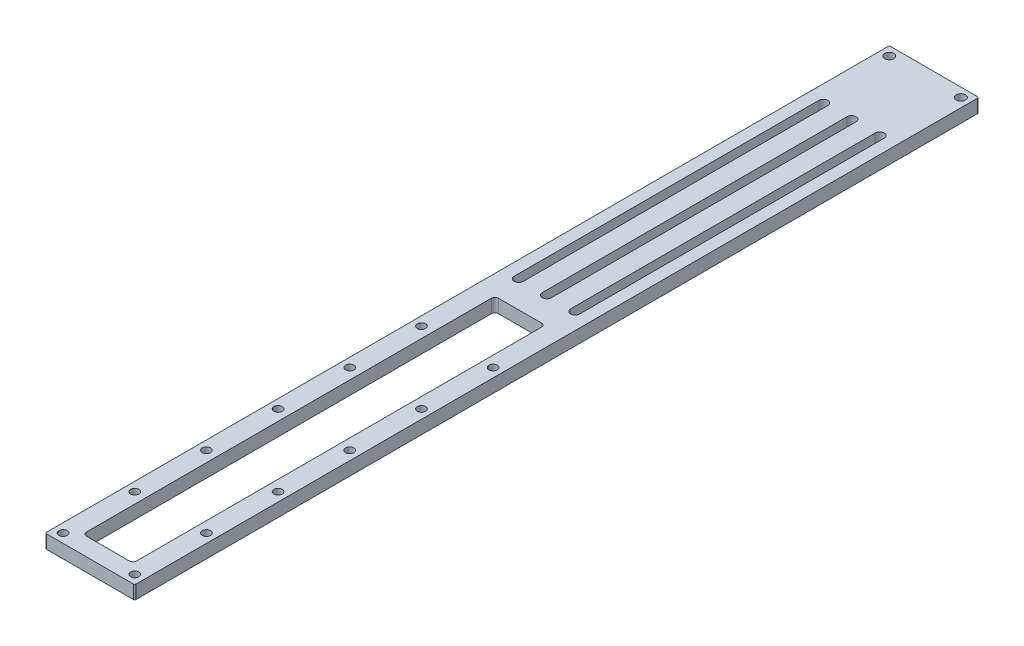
ISO-10303-21;
HEADER;
FILE_DESCRIPTION(('STEP AP214'),'2;1');
FILE_NAME('part.step','',(''),(''),'','','');
FILE_SCHEMA(('AUTOMOTIVE_DESIGN { 1 0 10303 214 1 1 1 1 }'));
ENDSEC;
DATA;
#1=APPLICATION_CONTEXT('core data for automotive mechanical design processes');
#2=APPLICATION_PROTOCOL_DEFINITION('international standard','automotive_design',2000,#1);
#3=PRODUCT_CONTEXT('',#1,'mechanical');
#4=PRODUCT('Part','Part','',(#3));
#5=PRODUCT_RELATED_PRODUCT_CATEGORY('part','',(#4));
#6=PRODUCT_DEFINITION_FORMATION('','',#4);
#7=PRODUCT_DEFINITION_CONTEXT('part definition',#1,'design');
#8=PRODUCT_DEFINITION('design','',#6,#7);
#9=PRODUCT_DEFINITION_SHAPE('','',#8);
#10=(LENGTH_UNIT() NAMED_UNIT(*) SI_UNIT(.MILLI.,.METRE.));
#11=(NAMED_UNIT(*) PLANE_ANGLE_UNIT() SI_UNIT($,.RADIAN.));
#12=(NAMED_UNIT(*) SI_UNIT($,.STERADIAN.) SOLID_ANGLE_UNIT());
#13=UNCERTAINTY_MEASURE_WITH_UNIT(LENGTH_MEASURE(1.E-05),#10,'distance_accuracy_value','');
#14=(GEOMETRIC_REPRESENTATION_CONTEXT(3) GLOBAL_UNCERTAINTY_ASSIGNED_CONTEXT((#13)) GLOBAL_UNIT_ASSIGNED_CONTEXT((#10,
#11,#12)) REPRESENTATION_CONTEXT('',''));
#15=CARTESIAN_POINT('',(0.,0.,0.));
#16=DIRECTION('',(0.,0.,1.));
#17=DIRECTION('',(1.,0.,0.));
#18=AXIS2_PLACEMENT_3D('',#15,#16,#17);
#19=CARTESIAN_POINT('',(-12.7,2.38125,168.9608));
#20=DIRECTION('',(0.,1.,0.));
#21=DIRECTION('',(0.,0.,1.));
#22=AXIS2_PLACEMENT_3D('',#19,#20,#21);
#23=CYLINDRICAL_SURFACE('',#22,1.4732);
#24=CARTESIAN_POINT('',(-12.7,2.38125,168.9608));
#25=DIRECTION('',(0.,1.,0.));
#26=DIRECTION('',(0.,0.,1.));
#27=AXIS2_PLACEMENT_3D('',#24,#25,#26);
#28=CIRCLE('',#27,1.4732);
#29=CARTESIAN_POINT('',(-12.7,2.38125,170.434));
#30=VERTEX_POINT('',#29);
#31=EDGE_CURVE('E40',#30,#30,#28,.T.);
#32=ORIENTED_EDGE('',*,*,#31,.T.);
#33=EDGE_LOOP('',(#32));
#34=FACE_BOUND('',#33,.T.);
#35=CARTESIAN_POINT('',(-12.7,-2.38125,168.9608));
#36=DIRECTION('',(0.,1.,0.));
#37=DIRECTION('',(0.,0.,1.));
#38=AXIS2_PLACEMENT_3D('',#35,#36,#37);
#39=CIRCLE('',#38,1.4732);
#40=CARTESIAN_POINT('',(-12.7,-2.38125,170.434));
#41=VERTEX_POINT('',#40);
#42=EDGE_CURVE('E11',#41,#41,#39,.T.);
#43=ORIENTED_EDGE('',*,*,#42,.F.);
#44=EDGE_LOOP('',(#43));
#45=FACE_BOUND('',#44,.T.);
#46=ADVANCED_FACE('F33',(#34,#45),#23,.F.);
#47=CARTESIAN_POINT('',(-12.7,2.38125,194.3608));
#48=DIRECTION('',(0.,1.,0.));
#49=DIRECTION('',(0.,0.,1.));
#50=AXIS2_PLACEMENT_3D('',#47,#48,#49);
#51=CYLINDRICAL_SURFACE('',#50,1.4732);
#52=CARTESIAN_POINT('',(-12.7,2.38125,194.3608));
#53=DIRECTION('',(0.,1.,0.));
#54=DIRECTION('',(0.,0.,1.));
#55=AXIS2_PLACEMENT_3D('',#52,#53,#54);
#56=CIRCLE('',#55,1.4732);
#57=CARTESIAN_POINT('',(-12.7,2.38125,195.834));
#58=VERTEX_POINT('',#57);
#59=EDGE_CURVE('E488',#58,#58,#56,.T.);
#60=ORIENTED_EDGE('',*,*,#59,.T.);
#61=EDGE_LOOP('',(#60));
#62=FACE_BOUND('',#61,.T.);
#63=CARTESIAN_POINT('',(-12.7,-2.38125,194.3608));
#64=DIRECTION('',(0.,1.,0.));
#65=DIRECTION('',(0.,0.,1.));
#66=AXIS2_PLACEMENT_3D('',#63,#64,#65);
#67=CIRCLE('',#66,1.4732);
#68=CARTESIAN_POINT('',(-12.7,-2.38125,195.834));
#69=VERTEX_POINT('',#68);
#70=EDGE_CURVE('E491',#69,#69,#67,.T.);
#71=ORIENTED_EDGE('',*,*,#70,.F.);
#72=EDGE_LOOP('',(#71));
#73=FACE_BOUND('',#72,.T.);
#74=ADVANCED_FACE('F516',(#62,#73),#51,.F.);
#75=CARTESIAN_POINT('',(-12.7,2.38125,219.7608));
#76=DIRECTION('',(0.,1.,0.));
#77=DIRECTION('',(0.,0.,1.));
#78=AXIS2_PLACEMENT_3D('',#75,#76,#77);
#79=CYLINDRICAL_SURFACE('',#78,1.4732);
#80=CARTESIAN_POINT('',(-12.7,2.38125,219.7608));
#81=DIRECTION('',(0.,1.,0.));
#82=DIRECTION('',(0.,0.,1.));
#83=AXIS2_PLACEMENT_3D('',#80,#81,#82);
#84=CIRCLE('',#83,1.4732);
#85=CARTESIAN_POINT('',(-12.7,2.38125,221.234));
#86=VERTEX_POINT('',#85);
#87=EDGE_CURVE('E482',#86,#86,#84,.T.);
#88=ORIENTED_EDGE('',*,*,#87,.T.);
#89=EDGE_LOOP('',(#88));
#90=FACE_BOUND('',#89,.T.);
#91=CARTESIAN_POINT('',(-12.7,-2.38125,219.7608));
#92=DIRECTION('',(0.,1.,0.));
#93=DIRECTION('',(0.,0.,1.));
#94=AXIS2_PLACEMENT_3D('',#91,#92,#93);
#95=CIRCLE('',#94,1.4732);
#96=CARTESIAN_POINT('',(-12.7,-2.38125,221.234));
#97=VERTEX_POINT('',#96);
#98=EDGE_CURVE('E485',#97,#97,#95,.T.);
#99=ORIENTED_EDGE('',*,*,#98,.F.);
#100=EDGE_LOOP('',(#99));
#101=FACE_BOUND('',#100,.T.);
#102=ADVANCED_FACE('F520',(#90,#101),#79,.F.);
#103=CARTESIAN_POINT('',(-12.7,2.38125,245.1608));
#104=DIRECTION('',(0.,1.,0.));
#105=DIRECTION('',(0.,0.,1.));
#106=AXIS2_PLACEMENT_3D('',#103,#104,#105);
#107=CYLINDRICAL_SURFACE('',#106,1.4732);
#108=CARTESIAN_POINT('',(-12.7,2.38125,245.1608));
#109=DIRECTION('',(0.,1.,0.));
#110=DIRECTION('',(0.,0.,1.));
#111=AXIS2_PLACEMENT_3D('',#108,#109,#110);
#112=CIRCLE('',#111,1.4732);
#113=CARTESIAN_POINT('',(-12.7,2.38125,246.634));
#114=VERTEX_POINT('',#113);
#115=EDGE_CURVE('E476',#114,#114,#112,.T.);
#116=ORIENTED_EDGE('',*,*,#115,.T.);
#117=EDGE_LOOP('',(#116));
#118=FACE_BOUND('',#117,.T.);
#119=CARTESIAN_POINT('',(-12.7,-2.38125,245.1608));
#120=DIRECTION('',(0.,1.,0.));
#121=DIRECTION('',(0.,0.,1.));
#122=AXIS2_PLACEMENT_3D('',#119,#120,#121);
#123=CIRCLE('',#122,1.4732);
#124=CARTESIAN_POINT('',(-12.7,-2.38125,246.634));
#125=VERTEX_POINT('',#124);
#126=EDGE_CURVE('E479',#125,#125,#123,.T.);
#127=ORIENTED_EDGE('',*,*,#126,.F.);
#128=EDGE_LOOP('',(#127));
#129=FACE_BOUND('',#128,.T.);
#130=ADVANCED_FACE('F525',(#118,#129),#107,.F.);
#131=CARTESIAN_POINT('',(12.7,2.38125,168.9608));
#132=DIRECTION('',(0.,1.,0.));
#133=DIRECTION('',(0.,0.,1.));
#134=AXIS2_PLACEMENT_3D('',#131,#132,#133);
#135=CYLINDRICAL_SURFACE('',#134,1.4732);
#136=CARTESIAN_POINT('',(12.7,2.38125,168.9608));
#137=DIRECTION('',(0.,1.,0.));
#138=DIRECTION('',(0.,0.,1.));
#139=AXIS2_PLACEMENT_3D('',#136,#137,#138);
#140=CIRCLE('',#139,1.4732);
#141=CARTESIAN_POINT('',(12.7,2.38125,170.434));
#142=VERTEX_POINT('',#141);
#143=EDGE_CURVE('E470',#142,#142,#140,.T.);
#144=ORIENTED_EDGE('',*,*,#143,.T.);
#145=EDGE_LOOP('',(#144));
#146=FACE_BOUND('',#145,.T.);
#147=CARTESIAN_POINT('',(12.7,-2.38125,168.9608));
#148=DIRECTION('',(0.,1.,0.));
#149=DIRECTION('',(0.,0.,1.));
#150=AXIS2_PLACEMENT_3D('',#147,#148,#149);
#151=CIRCLE('',#150,1.4732);
#152=CARTESIAN_POINT('',(12.7,-2.38125,170.434));
#153=VERTEX_POINT('',#152);
#154=EDGE_CURVE('E473',#153,#153,#151,.T.);
#155=ORIENTED_EDGE('',*,*,#154,.F.);
#156=EDGE_LOOP('',(#155));
#157=FACE_BOUND('',#156,.T.);
#158=ADVANCED_FACE('F532',(#146,#157),#135,.F.);
#159=CARTESIAN_POINT('',(12.7,2.38125,194.3608));
#160=DIRECTION('',(0.,1.,0.));
#161=DIRECTION('',(0.,0.,1.));
#162=AXIS2_PLACEMENT_3D('',#159,#160,#161);
#163=CYLINDRICAL_SURFACE('',#162,1.4732);
#164=CARTESIAN_POINT('',(12.7,2.38125,194.3608));
#165=DIRECTION('',(0.,1.,0.));
#166=DIRECTION('',(0.,0.,1.));
#167=AXIS2_PLACEMENT_3D('',#164,#165,#166);
#168=CIRCLE('',#167,1.4732);
#169=CARTESIAN_POINT('',(12.7,2.38125,195.834));
#170=VERTEX_POINT('',#169);
#171=EDGE_CURVE('E464',#170,#170,#168,.T.);
#172=ORIENTED_EDGE('',*,*,#171,.T.);
#173=EDGE_LOOP('',(#172));
#174=FACE_BOUND('',#173,.T.);
#175=CARTESIAN_POINT('',(12.7,-2.38125,194.3608));
#176=DIRECTION('',(0.,1.,0.));
#177=DIRECTION('',(0.,0.,1.));
#178=AXIS2_PLACEMENT_3D('',#175,#176,#177);
#179=CIRCLE('',#178,1.4732);
#180=CARTESIAN_POINT('',(12.7,-2.38125,195.834));
#181=VERTEX_POINT('',#180);
#182=EDGE_CURVE('E467',#181,#181,#179,.T.);
#183=ORIENTED_EDGE('',*,*,#182,.F.);
#184=EDGE_LOOP('',(#183));
#185=FACE_BOUND('',#184,.T.);
#186=ADVANCED_FACE('F536',(#174,#185),#163,.F.);
#187=CARTESIAN_POINT('',(12.7,2.38125,219.7608));
#188=DIRECTION('',(0.,1.,0.));
#189=DIRECTION('',(0.,0.,1.));
#190=AXIS2_PLACEMENT_3D('',#187,#188,#189);
#191=CYLINDRICAL_SURFACE('',#190,1.4732);
#192=CARTESIAN_POINT('',(12.7,2.38125,219.7608));
#193=DIRECTION('',(0.,1.,0.));
#194=DIRECTION('',(0.,0.,1.));
#195=AXIS2_PLACEMENT_3D('',#192,#193,#194);
#196=CIRCLE('',#195,1.4732);
#197=CARTESIAN_POINT('',(12.7,2.38125,221.234));
#198=VERTEX_POINT('',#197);
#199=EDGE_CURVE('E458',#198,#198,#196,.T.);
#200=ORIENTED_EDGE('',*,*,#199,.T.);
#201=EDGE_LOOP('',(#200));
#202=FACE_BOUND('',#201,.T.);
#203=CARTESIAN_POINT('',(12.7,-2.38125,219.7608));
#204=DIRECTION('',(0.,1.,0.));
#205=DIRECTION('',(0.,0.,1.));
#206=AXIS2_PLACEMENT_3D('',#203,#204,#205);
#207=CIRCLE('',#206,1.4732);
#208=CARTESIAN_POINT('',(12.7,-2.38125,221.234));
#209=VERTEX_POINT('',#208);
#210=EDGE_CURVE('E461',#209,#209,#207,.T.);
#211=ORIENTED_EDGE('',*,*,#210,.F.);
#212=EDGE_LOOP('',(#211));
#213=FACE_BOUND('',#212,.T.);
#214=ADVANCED_FACE('F540',(#202,#213),#191,.F.);
#215=CARTESIAN_POINT('',(12.7,2.38125,245.1608));
#216=DIRECTION('',(0.,1.,0.));
#217=DIRECTION('',(0.,0.,1.));
#218=AXIS2_PLACEMENT_3D('',#215,#216,#217);
#219=CYLINDRICAL_SURFACE('',#218,1.4732);
#220=CARTESIAN_POINT('',(12.7,2.38125,245.1608));
#221=DIRECTION('',(0.,1.,0.));
#222=DIRECTION('',(0.,0.,1.));
#223=AXIS2_PLACEMENT_3D('',#220,#221,#222);
#224=CIRCLE('',#223,1.4732);
#225=CARTESIAN_POINT('',(12.7,2.38125,246.634));
#226=VERTEX_POINT('',#225);
#227=EDGE_CURVE('E452',#226,#226,#224,.T.);
#228=ORIENTED_EDGE('',*,*,#227,.T.);
#229=EDGE_LOOP('',(#228));
#230=FACE_BOUND('',#229,.T.);
#231=CARTESIAN_POINT('',(12.7,-2.38125,245.1608));
#232=DIRECTION('',(0.,1.,0.));
#233=DIRECTION('',(0.,0.,1.));
#234=AXIS2_PLACEMENT_3D('',#231,#232,#233);
#235=CIRCLE('',#234,1.4732);
#236=CARTESIAN_POINT('',(12.7,-2.38125,246.634));
#237=VERTEX_POINT('',#236);
#238=EDGE_CURVE('E455',#237,#237,#235,.T.);
#239=ORIENTED_EDGE('',*,*,#238,.F.);
#240=EDGE_LOOP('',(#239));
#241=FACE_BOUND('',#240,.T.);
#242=ADVANCED_FACE('F510',(#230,#241),#219,.F.);
#243=CARTESIAN_POINT('',(15.875,2.38125,308.6608));
#244=DIRECTION('',(-1.,0.,0.));
#245=DIRECTION('',(0.,0.,1.));
#246=AXIS2_PLACEMENT_3D('',#243,#244,#245);
#247=PLANE('',#246);
#248=DIRECTION('',(0.,0.,-1.));
#249=VECTOR('',#248,1.);
#250=CARTESIAN_POINT('',(15.875,-2.38125,308.6608));
#251=LINE('',#250,#249);
#252=CARTESIAN_POINT('',(15.875,-2.38125,298.6278));
#253=VERTEX_POINT('',#252);
#254=CARTESIAN_POINT('',(15.875,-2.38125,0.508000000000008));
#255=VERTEX_POINT('',#254);
#256=EDGE_CURVE('E355',#253,#255,#251,.T.);
#257=ORIENTED_EDGE('',*,*,#256,.T.);
#258=DIRECTION('',(0.,1.,0.));
#259=VECTOR('',#258,1.);
#260=CARTESIAN_POINT('',(15.875,2.38125,0.508000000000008));
#261=LINE('',#260,#259);
#262=CARTESIAN_POINT('',(15.875,2.38125,0.508000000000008));
#263=VERTEX_POINT('',#262);
#264=EDGE_CURVE('E444',#255,#263,#261,.T.);
#265=ORIENTED_EDGE('',*,*,#264,.T.);
#266=DIRECTION('',(0.,0.,-1.));
#267=VECTOR('',#266,1.);
#268=CARTESIAN_POINT('',(15.875,2.38125,308.6608));
#269=LINE('',#268,#267);
#270=CARTESIAN_POINT('',(15.875,2.38125,298.6278));
#271=VERTEX_POINT('',#270);
#272=EDGE_CURVE('E364',#271,#263,#269,.T.);
#273=ORIENTED_EDGE('',*,*,#272,.F.);
#274=DIRECTION('',(0.,1.,0.));
#275=VECTOR('',#274,1.);
#276=CARTESIAN_POINT('',(15.875,-2.38125,298.6278));
#277=LINE('',#276,#275);
#278=EDGE_CURVE('E442',#271,#253,#277,.F.);
#279=ORIENTED_EDGE('',*,*,#278,.T.);
#280=EDGE_LOOP('',(#257,#265,#273,#279));
#281=FACE_BOUND('',#280,.T.);
#282=ADVANCED_FACE('F501',(#281),#247,.F.);
#283=CARTESIAN_POINT('',(-15.875,2.38125,308.6608));
#284=DIRECTION('',(0.,-1.,0.));
#285=DIRECTION('',(0.,0.,-1.));
#286=AXIS2_PLACEMENT_3D('',#283,#284,#285);
#287=PLANE('',#286);
#288=CARTESIAN_POINT('',(-12.7,2.38125,270.5608));
#289=DIRECTION('',(0.,1.,0.));
#290=DIRECTION('',(0.,0.,1.));
#291=AXIS2_PLACEMENT_3D('',#288,#289,#290);
#292=CIRCLE('',#291,1.4732);
#293=CARTESIAN_POINT('',(-12.7,2.38125,272.034));
#294=VERTEX_POINT('',#293);
#295=EDGE_CURVE('E744',#294,#294,#292,.T.);
#296=ORIENTED_EDGE('',*,*,#295,.F.);
#297=EDGE_LOOP('',(#296));
#298=FACE_BOUND('',#297,.T.);
#299=CARTESIAN_POINT('',(12.7,2.38125,270.5608));
#300=DIRECTION('',(0.,1.,0.));
#301=DIRECTION('',(0.,0.,1.));
#302=AXIS2_PLACEMENT_3D('',#299,#300,#301);
#303=CIRCLE('',#302,1.4732);
#304=CARTESIAN_POINT('',(12.7,2.38125,272.034));
#305=VERTEX_POINT('',#304);
#306=EDGE_CURVE('E747',#305,#305,#303,.T.);
#307=ORIENTED_EDGE('',*,*,#306,.F.);
#308=EDGE_LOOP('',(#307));
#309=FACE_BOUND('',#308,.T.);
#310=DIRECTION('',(1.,0.,0.));
#311=VECTOR('',#310,1.);
#312=CARTESIAN_POINT('',(-8.88999999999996,2.38125,292.7858));
#313=LINE('',#312,#311);
#314=CARTESIAN_POINT('',(-7.61999999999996,2.38125,292.7858));
#315=VERTEX_POINT('',#314);
#316=CARTESIAN_POINT('',(7.62000000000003,2.38125,292.7858));
#317=VERTEX_POINT('',#316);
#318=EDGE_CURVE('E340',#315,#317,#313,.T.);
#319=ORIENTED_EDGE('',*,*,#318,.F.);
#320=CARTESIAN_POINT('',(-7.61999999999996,2.38125,291.5158));
#321=DIRECTION('',(0.,-1.,0.));
#322=DIRECTION('',(0.,0.,-1.));
#323=AXIS2_PLACEMENT_3D('',#320,#321,#322);
#324=CIRCLE('',#323,1.27);
#325=CARTESIAN_POINT('',(-8.88999999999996,2.38125,291.5158));
#326=VERTEX_POINT('',#325);
#327=EDGE_CURVE('E411',#315,#326,#324,.T.);
#328=ORIENTED_EDGE('',*,*,#327,.T.);
#329=DIRECTION('',(0.,0.,1.));
#330=VECTOR('',#329,1.);
#331=CARTESIAN_POINT('',(-8.88999999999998,2.38125,146.7358));
#332=LINE('',#331,#330);
#333=CARTESIAN_POINT('',(-8.88999999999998,2.38125,148.0058));
#334=VERTEX_POINT('',#333);
#335=EDGE_CURVE('E337',#334,#326,#332,.T.);
#336=ORIENTED_EDGE('',*,*,#335,.F.);
#337=CARTESIAN_POINT('',(-7.61999999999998,2.38125,148.0058));
#338=DIRECTION('',(0.,-1.,0.));
#339=DIRECTION('',(0.,0.,-1.));
#340=AXIS2_PLACEMENT_3D('',#337,#338,#339);
#341=CIRCLE('',#340,1.27);
#342=CARTESIAN_POINT('',(-7.61999999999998,2.38125,146.7358));
#343=VERTEX_POINT('',#342);
#344=EDGE_CURVE('E403',#334,#343,#341,.T.);
#345=ORIENTED_EDGE('',*,*,#344,.T.);
#346=DIRECTION('',(-1.,0.,0.));
#347=VECTOR('',#346,1.);
#348=CARTESIAN_POINT('',(-8.88999999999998,2.38125,146.7358));
#349=LINE('',#348,#347);
#350=CARTESIAN_POINT('',(7.62000000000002,2.38125,146.7358));
#351=VERTEX_POINT('',#350);
#352=EDGE_CURVE('E346',#351,#343,#349,.T.);
#353=ORIENTED_EDGE('',*,*,#352,.F.);
#354=CARTESIAN_POINT('',(7.62000000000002,2.38125,148.0058));
#355=DIRECTION('',(0.,-1.,0.));
#356=DIRECTION('',(0.,0.,-1.));
#357=AXIS2_PLACEMENT_3D('',#354,#355,#356);
#358=CIRCLE('',#357,1.27);
#359=CARTESIAN_POINT('',(8.89000000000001,2.38125,148.0058));
#360=VERTEX_POINT('',#359);
#361=EDGE_CURVE('E407',#351,#360,#358,.T.);
#362=ORIENTED_EDGE('',*,*,#361,.T.);
#363=DIRECTION('',(0.,0.,-1.));
#364=VECTOR('',#363,1.);
#365=CARTESIAN_POINT('',(8.89000000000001,2.38125,146.7358));
#366=LINE('',#365,#364);
#367=CARTESIAN_POINT('',(8.89000000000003,2.38125,291.5158));
#368=VERTEX_POINT('',#367);
#369=EDGE_CURVE('E343',#368,#360,#366,.T.);
#370=ORIENTED_EDGE('',*,*,#369,.F.);
#371=CARTESIAN_POINT('',(7.62000000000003,2.38125,291.5158));
#372=DIRECTION('',(0.,-1.,0.));
#373=DIRECTION('',(0.,0.,-1.));
#374=AXIS2_PLACEMENT_3D('',#371,#372,#373);
#375=CIRCLE('',#374,1.27);
#376=EDGE_CURVE('E415',#368,#317,#375,.T.);
#377=ORIENTED_EDGE('',*,*,#376,.T.);
#378=EDGE_LOOP('',(#319,#328,#336,#345,#353,#362,#370,#377));
#379=FACE_BOUND('',#378,.T.);
#380=CARTESIAN_POINT('',(-12.7,2.38125,295.9608));
#381=DIRECTION('',(0.,1.,0.));
#382=DIRECTION('',(0.,0.,1.));
#383=AXIS2_PLACEMENT_3D('',#380,#381,#382);
#384=CIRCLE('',#383,1.4732);
#385=CARTESIAN_POINT('',(-12.7,2.38125,297.434));
#386=VERTEX_POINT('',#385);
#387=EDGE_CURVE('E333',#386,#386,#384,.T.);
#388=ORIENTED_EDGE('',*,*,#387,.F.);
#389=EDGE_LOOP('',(#388));
#390=FACE_BOUND('',#389,.T.);
#391=CARTESIAN_POINT('',(12.7,2.38125,295.9608));
#392=DIRECTION('',(0.,1.,0.));
#393=DIRECTION('',(0.,0.,1.));
#394=AXIS2_PLACEMENT_3D('',#391,#392,#393);
#395=CIRCLE('',#394,1.4732);
#396=CARTESIAN_POINT('',(12.7,2.38125,297.434));
#397=VERTEX_POINT('',#396);
#398=EDGE_CURVE('E327',#397,#397,#395,.T.);
#399=ORIENTED_EDGE('',*,*,#398,.F.);
#400=EDGE_LOOP('',(#399));
#401=FACE_BOUND('',#400,.T.);
#402=DIRECTION('',(0.,0.,1.));
#403=VECTOR('',#402,1.);
#404=CARTESIAN_POINT('',(1.61448864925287,2.38125,308.6608));
#405=LINE('',#404,#403);
#406=CARTESIAN_POINT('',(1.61448864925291,2.38125,29.2608));
#407=VERTEX_POINT('',#406);
#408=CARTESIAN_POINT('',(1.61448864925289,2.38125,137.2108));
#409=VERTEX_POINT('',#408);
#410=EDGE_CURVE('E321',#407,#409,#405,.T.);
#411=ORIENTED_EDGE('',*,*,#410,.T.);
#412=CARTESIAN_POINT('',(0.014488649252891,2.38125,137.2108));
#413=DIRECTION('',(0.,-1.,0.));
#414=DIRECTION('',(0.,0.,-1.));
#415=AXIS2_PLACEMENT_3D('',#412,#413,#414);
#416=CIRCLE('',#415,1.6);
#417=CARTESIAN_POINT('',(-1.58551135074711,2.38125,137.2108));
#418=VERTEX_POINT('',#417);
#419=EDGE_CURVE('E324',#409,#418,#416,.T.);
#420=ORIENTED_EDGE('',*,*,#419,.T.);
#421=DIRECTION('',(0.,0.,-1.));
#422=VECTOR('',#421,1.);
#423=CARTESIAN_POINT('',(-1.58551135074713,2.38125,308.6608));
#424=LINE('',#423,#422);
#425=CARTESIAN_POINT('',(-1.58551135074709,2.38125,29.2607999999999));
#426=VERTEX_POINT('',#425);
#427=EDGE_CURVE('E309',#418,#426,#424,.T.);
#428=ORIENTED_EDGE('',*,*,#427,.T.);
#429=CARTESIAN_POINT('',(0.0144886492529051,2.38125,29.2608));
#430=DIRECTION('',(0.,-1.,0.));
#431=DIRECTION('',(0.,0.,-1.));
#432=AXIS2_PLACEMENT_3D('',#429,#430,#431);
#433=CIRCLE('',#432,1.6);
#434=EDGE_CURVE('E318',#426,#407,#433,.T.);
#435=ORIENTED_EDGE('',*,*,#434,.T.);
#436=EDGE_LOOP('',(#411,#420,#428,#435));
#437=FACE_BOUND('',#436,.T.);
#438=DIRECTION('',(0.,0.,1.));
#439=VECTOR('',#438,1.);
#440=CARTESIAN_POINT('',(-8.38551135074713,2.38125,308.6608));
#441=LINE('',#440,#439);
#442=CARTESIAN_POINT('',(-8.38551135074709,2.38125,29.2608));
#443=VERTEX_POINT('',#442);
#444=CARTESIAN_POINT('',(-8.38551135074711,2.38125,137.2108));
#445=VERTEX_POINT('',#444);
#446=EDGE_CURVE('E289',#443,#445,#441,.T.);
#447=ORIENTED_EDGE('',*,*,#446,.T.);
#448=CARTESIAN_POINT('',(-9.98551135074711,2.38125,137.2108));
#449=DIRECTION('',(0.,-1.,0.));
#450=DIRECTION('',(0.,0.,-1.));
#451=AXIS2_PLACEMENT_3D('',#448,#449,#450);
#452=CIRCLE('',#451,1.6);
#453=CARTESIAN_POINT('',(-11.5855113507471,2.38125,137.2108));
#454=VERTEX_POINT('',#453);
#455=EDGE_CURVE('E292',#445,#454,#452,.T.);
#456=ORIENTED_EDGE('',*,*,#455,.T.);
#457=DIRECTION('',(0.,0.,-1.));
#458=VECTOR('',#457,1.);
#459=CARTESIAN_POINT('',(-11.5855113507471,2.38125,308.6608));
#460=LINE('',#459,#458);
#461=CARTESIAN_POINT('',(-11.5855113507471,2.38125,29.2607999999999));
#462=VERTEX_POINT('',#461);
#463=EDGE_CURVE('E277',#454,#462,#460,.T.);
#464=ORIENTED_EDGE('',*,*,#463,.T.);
#465=CARTESIAN_POINT('',(-9.9855113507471,2.38125,29.2608));
#466=DIRECTION('',(0.,-1.,0.));
#467=DIRECTION('',(0.,0.,-1.));
#468=AXIS2_PLACEMENT_3D('',#465,#466,#467);
#469=CIRCLE('',#468,1.6);
#470=EDGE_CURVE('E286',#462,#443,#469,.T.);
#471=ORIENTED_EDGE('',*,*,#470,.T.);
#472=EDGE_LOOP('',(#447,#456,#464,#471));
#473=FACE_BOUND('',#472,.T.);
#474=DIRECTION('',(0.,0.,1.));
#475=VECTOR('',#474,1.);
#476=CARTESIAN_POINT('',(11.6144886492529,2.38125,308.6608));
#477=LINE('',#476,#475);
#478=CARTESIAN_POINT('',(11.6144886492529,2.38125,29.2608));
#479=VERTEX_POINT('',#478);
#480=CARTESIAN_POINT('',(11.6144886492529,2.38125,137.2108));
#481=VERTEX_POINT('',#480);
#482=EDGE_CURVE('E257',#479,#481,#477,.T.);
#483=ORIENTED_EDGE('',*,*,#482,.T.);
#484=CARTESIAN_POINT('',(10.0144886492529,2.38125,137.2108));
#485=DIRECTION('',(0.,-1.,0.));
#486=DIRECTION('',(0.,0.,-1.));
#487=AXIS2_PLACEMENT_3D('',#484,#485,#486);
#488=CIRCLE('',#487,1.6);
#489=CARTESIAN_POINT('',(8.41448864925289,2.38125,137.2108));
#490=VERTEX_POINT('',#489);
#491=EDGE_CURVE('E260',#481,#490,#488,.T.);
#492=ORIENTED_EDGE('',*,*,#491,.T.);
#493=DIRECTION('',(0.,0.,-1.));
#494=VECTOR('',#493,1.);
#495=CARTESIAN_POINT('',(8.41448864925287,2.38125,308.6608));
#496=LINE('',#495,#494);
#497=CARTESIAN_POINT('',(8.41448864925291,2.38125,29.2607999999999));
#498=VERTEX_POINT('',#497);
#499=EDGE_CURVE('E252',#490,#498,#496,.T.);
#500=ORIENTED_EDGE('',*,*,#499,.T.);
#501=CARTESIAN_POINT('',(10.0144886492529,2.38125,29.2608));
#502=DIRECTION('',(0.,-1.,0.));
#503=DIRECTION('',(0.,0.,-1.));
#504=AXIS2_PLACEMENT_3D('',#501,#502,#503);
#505=CIRCLE('',#504,1.6);
#506=EDGE_CURVE('E227',#498,#479,#505,.T.);
#507=ORIENTED_EDGE('',*,*,#506,.T.);
#508=EDGE_LOOP('',(#483,#492,#500,#507));
#509=FACE_BOUND('',#508,.T.);
#510=CARTESIAN_POINT('',(-12.7,2.38125,3.175));
#511=DIRECTION('',(0.,1.,0.));
#512=DIRECTION('',(0.,0.,1.));
#513=AXIS2_PLACEMENT_3D('',#510,#511,#512);
#514=CIRCLE('',#513,1.63195);
#515=CARTESIAN_POINT('',(-12.7,2.38125,4.80695));
#516=VERTEX_POINT('',#515);
#517=EDGE_CURVE('E628',#516,#516,#514,.T.);
#518=ORIENTED_EDGE('',*,*,#517,.F.);
#519=EDGE_LOOP('',(#518));
#520=FACE_BOUND('',#519,.T.);
#521=CARTESIAN_POINT('',(12.7,2.38125,3.175));
#522=DIRECTION('',(0.,1.,0.));
#523=DIRECTION('',(0.,0.,1.));
#524=AXIS2_PLACEMENT_3D('',#521,#522,#523);
#525=CIRCLE('',#524,1.63195);
#526=CARTESIAN_POINT('',(12.7,2.38125,4.80695));
#527=VERTEX_POINT('',#526);
#528=EDGE_CURVE('E631',#527,#527,#525,.T.);
#529=ORIENTED_EDGE('',*,*,#528,.F.);
#530=EDGE_LOOP('',(#529));
#531=FACE_BOUND('',#530,.T.);
#532=DIRECTION('',(-1.,0.,0.));
#533=VECTOR('',#532,1.);
#534=CARTESIAN_POINT('',(-15.875,2.38125,0.));
#535=LINE('',#534,#533);
#536=CARTESIAN_POINT('',(15.367,2.38125,0.));
#537=VERTEX_POINT('',#536);
#538=CARTESIAN_POINT('',(-15.367,2.38125,0.));
#539=VERTEX_POINT('',#538);
#540=EDGE_CURVE('E349',#537,#539,#535,.T.);
#541=ORIENTED_EDGE('',*,*,#540,.T.);
#542=CARTESIAN_POINT('',(-15.367,2.38125,0.508000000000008));
#543=DIRECTION('',(0.,-1.,0.));
#544=DIRECTION('',(0.,0.,-1.));
#545=AXIS2_PLACEMENT_3D('',#542,#543,#544);
#546=CIRCLE('',#545,0.508);
#547=CARTESIAN_POINT('',(-15.875,2.38125,0.508000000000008));
#548=VERTEX_POINT('',#547);
#549=EDGE_CURVE('E440',#539,#548,#546,.F.);
#550=ORIENTED_EDGE('',*,*,#549,.T.);
#551=DIRECTION('',(0.,0.,-1.));
#552=VECTOR('',#551,1.);
#553=CARTESIAN_POINT('',(-15.875,2.38125,308.6608));
#554=LINE('',#553,#552);
#555=CARTESIAN_POINT('',(-15.875,2.38125,298.6278));
#556=VERTEX_POINT('',#555);
#557=EDGE_CURVE('E361',#556,#548,#554,.T.);
#558=ORIENTED_EDGE('',*,*,#557,.F.);
#559=CARTESIAN_POINT('',(-15.367,2.38125,298.6278));
#560=DIRECTION('',(0.,-1.,0.));
#561=DIRECTION('',(0.,0.,-1.));
#562=AXIS2_PLACEMENT_3D('',#559,#560,#561);
#563=CIRCLE('',#562,0.508);
#564=CARTESIAN_POINT('',(-15.367,2.38125,299.1358));
#565=VERTEX_POINT('',#564);
#566=EDGE_CURVE('E437',#556,#565,#563,.F.);
#567=ORIENTED_EDGE('',*,*,#566,.T.);
#568=DIRECTION('',(-1.,0.,0.));
#569=VECTOR('',#568,1.);
#570=CARTESIAN_POINT('',(-15.875,2.38125,299.1358));
#571=LINE('',#570,#569);
#572=CARTESIAN_POINT('',(15.367,2.38125,299.1358));
#573=VERTEX_POINT('',#572);
#574=EDGE_CURVE('E756',#573,#565,#571,.T.);
#575=ORIENTED_EDGE('',*,*,#574,.F.);
#576=CARTESIAN_POINT('',(15.367,2.38125,298.6278));
#577=DIRECTION('',(0.,-1.,0.));
#578=DIRECTION('',(0.,0.,-1.));
#579=AXIS2_PLACEMENT_3D('',#576,#577,#578);
#580=CIRCLE('',#579,0.508);
#581=EDGE_CURVE('E55',#573,#271,#580,.F.);
#582=ORIENTED_EDGE('',*,*,#581,.T.);
#583=ORIENTED_EDGE('',*,*,#272,.T.);
#584=CARTESIAN_POINT('',(15.367,2.38125,0.508000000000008));
#585=DIRECTION('',(0.,-1.,0.));
#586=DIRECTION('',(0.,0.,-1.));
#587=AXIS2_PLACEMENT_3D('',#584,#585,#586);
#588=CIRCLE('',#587,0.508);
#589=EDGE_CURVE('E47',#263,#537,#588,.F.);
#590=ORIENTED_EDGE('',*,*,#589,.T.);
#591=EDGE_LOOP('',(#541,#550,#558,#567,#575,#582,#583,#590));
#592=FACE_BOUND('',#591,.T.);
#593=ORIENTED_EDGE('',*,*,#227,.F.);
#594=EDGE_LOOP('',(#593));
#595=FACE_BOUND('',#594,.T.);
#596=ORIENTED_EDGE('',*,*,#199,.F.);
#597=EDGE_LOOP('',(#596));
#598=FACE_BOUND('',#597,.T.);
#599=ORIENTED_EDGE('',*,*,#171,.F.);
#600=EDGE_LOOP('',(#599));
#601=FACE_BOUND('',#600,.T.);
#602=ORIENTED_EDGE('',*,*,#143,.F.);
#603=EDGE_LOOP('',(#602));
#604=FACE_BOUND('',#603,.T.);
#605=ORIENTED_EDGE('',*,*,#115,.F.);
#606=EDGE_LOOP('',(#605));
#607=FACE_BOUND('',#606,.T.);
#608=ORIENTED_EDGE('',*,*,#87,.F.);
#609=EDGE_LOOP('',(#608));
#610=FACE_BOUND('',#609,.T.);
#611=ORIENTED_EDGE('',*,*,#59,.F.);
#612=EDGE_LOOP('',(#611));
#613=FACE_BOUND('',#612,.T.);
#614=ORIENTED_EDGE('',*,*,#31,.F.);
#615=EDGE_LOOP('',(#614));
#616=FACE_BOUND('',#615,.T.);
#617=ADVANCED_FACE('F498',(#298,#309,#379,#390,#401,#437,#473,#509,#520,#531,#592,#595,#598,
#601,#604,#607,#610,#613,#616),#287,.F.);
#618=CARTESIAN_POINT('',(-15.875,2.38125,308.6608));
#619=DIRECTION('',(1.,0.,0.));
#620=DIRECTION('',(0.,0.,-1.));
#621=AXIS2_PLACEMENT_3D('',#618,#619,#620);
#622=PLANE('',#621);
#623=ORIENTED_EDGE('',*,*,#557,.T.);
#624=DIRECTION('',(0.,-1.,0.));
#625=VECTOR('',#624,1.);
#626=CARTESIAN_POINT('',(-15.875,2.38125,0.508000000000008));
#627=LINE('',#626,#625);
#628=CARTESIAN_POINT('',(-15.875,-2.38125,0.508000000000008));
#629=VERTEX_POINT('',#628);
#630=EDGE_CURVE('E421',#548,#629,#627,.T.);
#631=ORIENTED_EDGE('',*,*,#630,.T.);
#632=DIRECTION('',(0.,0.,-1.));
#633=VECTOR('',#632,1.);
#634=CARTESIAN_POINT('',(-15.875,-2.38125,308.6608));
#635=LINE('',#634,#633);
#636=CARTESIAN_POINT('',(-15.875,-2.38125,298.6278));
#637=VERTEX_POINT('',#636);
#638=EDGE_CURVE('E358',#637,#629,#635,.T.);
#639=ORIENTED_EDGE('',*,*,#638,.F.);
#640=DIRECTION('',(0.,-1.,0.));
#641=VECTOR('',#640,1.);
#642=CARTESIAN_POINT('',(-15.875,2.38125,298.6278));
#643=LINE('',#642,#641);
#644=EDGE_CURVE('E419',#637,#556,#643,.F.);
#645=ORIENTED_EDGE('',*,*,#644,.T.);
#646=EDGE_LOOP('',(#623,#631,#639,#645));
#647=FACE_BOUND('',#646,.T.);
#648=ADVANCED_FACE('F500',(#647),#622,.F.);
#649=CARTESIAN_POINT('',(-15.875,-2.38125,308.6608));
#650=DIRECTION('',(0.,1.,0.));
#651=DIRECTION('',(0.,0.,1.));
#652=AXIS2_PLACEMENT_3D('',#649,#650,#651);
#653=PLANE('',#652);
#654=CARTESIAN_POINT('',(-12.7,-2.38125,270.5608));
#655=DIRECTION('',(0.,1.,0.));
#656=DIRECTION('',(0.,0.,1.));
#657=AXIS2_PLACEMENT_3D('',#654,#655,#656);
#658=CIRCLE('',#657,1.4732);
#659=CARTESIAN_POINT('',(-12.7,-2.38125,272.034));
#660=VERTEX_POINT('',#659);
#661=EDGE_CURVE('E746',#660,#660,#658,.T.);
#662=ORIENTED_EDGE('',*,*,#661,.T.);
#663=EDGE_LOOP('',(#662));
#664=FACE_BOUND('',#663,.T.);
#665=CARTESIAN_POINT('',(12.7,-2.38125,270.5608));
#666=DIRECTION('',(0.,1.,0.));
#667=DIRECTION('',(0.,0.,1.));
#668=AXIS2_PLACEMENT_3D('',#665,#666,#667);
#669=CIRCLE('',#668,1.4732);
#670=CARTESIAN_POINT('',(12.7,-2.38125,272.034));
#671=VERTEX_POINT('',#670);
#672=EDGE_CURVE('E750',#671,#671,#669,.T.);
#673=ORIENTED_EDGE('',*,*,#672,.T.);
#674=EDGE_LOOP('',(#673));
#675=FACE_BOUND('',#674,.T.);
#676=DIRECTION('',(0.,0.,-1.));
#677=VECTOR('',#676,1.);
#678=CARTESIAN_POINT('',(8.89000000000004,-2.38125,308.6608));
#679=LINE('',#678,#677);
#680=CARTESIAN_POINT('',(8.89000000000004,-2.38125,291.5158));
#681=VERTEX_POINT('',#680);
#682=CARTESIAN_POINT('',(8.89000000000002,-2.38125,148.0058));
#683=VERTEX_POINT('',#682);
#684=EDGE_CURVE('E369',#681,#683,#679,.T.);
#685=ORIENTED_EDGE('',*,*,#684,.T.);
#686=CARTESIAN_POINT('',(7.62000000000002,-2.38125,148.0058));
#687=DIRECTION('',(0.,1.,0.));
#688=DIRECTION('',(0.,0.,1.));
#689=AXIS2_PLACEMENT_3D('',#686,#687,#688);
#690=CIRCLE('',#689,1.27);
#691=CARTESIAN_POINT('',(7.62000000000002,-2.38125,146.7358));
#692=VERTEX_POINT('',#691);
#693=EDGE_CURVE('E409',#683,#692,#690,.T.);
#694=ORIENTED_EDGE('',*,*,#693,.T.);
#695=DIRECTION('',(-1.,0.,0.));
#696=VECTOR('',#695,1.);
#697=CARTESIAN_POINT('',(-15.875,-2.38125,146.7358));
#698=LINE('',#697,#696);
#699=CARTESIAN_POINT('',(-7.61999999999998,-2.38125,146.7358));
#700=VERTEX_POINT('',#699);
#701=EDGE_CURVE('E372',#692,#700,#698,.T.);
#702=ORIENTED_EDGE('',*,*,#701,.T.);
#703=CARTESIAN_POINT('',(-7.61999999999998,-2.38125,148.0058));
#704=DIRECTION('',(0.,1.,0.));
#705=DIRECTION('',(0.,0.,1.));
#706=AXIS2_PLACEMENT_3D('',#703,#704,#705);
#707=CIRCLE('',#706,1.27);
#708=CARTESIAN_POINT('',(-8.88999999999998,-2.38125,148.0058));
#709=VERTEX_POINT('',#708);
#710=EDGE_CURVE('E405',#700,#709,#707,.T.);
#711=ORIENTED_EDGE('',*,*,#710,.T.);
#712=DIRECTION('',(0.,0.,1.));
#713=VECTOR('',#712,1.);
#714=CARTESIAN_POINT('',(-8.88999999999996,-2.38125,308.6608));
#715=LINE('',#714,#713);
#716=CARTESIAN_POINT('',(-8.88999999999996,-2.38125,291.5158));
#717=VERTEX_POINT('',#716);
#718=EDGE_CURVE('E375',#709,#717,#715,.T.);
#719=ORIENTED_EDGE('',*,*,#718,.T.);
#720=CARTESIAN_POINT('',(-7.61999999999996,-2.38125,291.5158));
#721=DIRECTION('',(0.,1.,0.));
#722=DIRECTION('',(0.,0.,1.));
#723=AXIS2_PLACEMENT_3D('',#720,#721,#722);
#724=CIRCLE('',#723,1.27);
#725=CARTESIAN_POINT('',(-7.61999999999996,-2.38125,292.7858));
#726=VERTEX_POINT('',#725);
#727=EDGE_CURVE('E413',#717,#726,#724,.T.);
#728=ORIENTED_EDGE('',*,*,#727,.T.);
#729=DIRECTION('',(1.,0.,0.));
#730=VECTOR('',#729,1.);
#731=CARTESIAN_POINT('',(-15.875,-2.38125,292.7858));
#732=LINE('',#731,#730);
#733=CARTESIAN_POINT('',(7.62000000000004,-2.38125,292.7858));
#734=VERTEX_POINT('',#733);
#735=EDGE_CURVE('E366',#726,#734,#732,.T.);
#736=ORIENTED_EDGE('',*,*,#735,.T.);
#737=CARTESIAN_POINT('',(7.62000000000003,-2.38125,291.5158));
#738=DIRECTION('',(0.,1.,0.));
#739=DIRECTION('',(0.,0.,1.));
#740=AXIS2_PLACEMENT_3D('',#737,#738,#739);
#741=CIRCLE('',#740,1.27);
#742=EDGE_CURVE('E417',#734,#681,#741,.T.);
#743=ORIENTED_EDGE('',*,*,#742,.T.);
#744=EDGE_LOOP('',(#685,#694,#702,#711,#719,#728,#736,#743));
#745=FACE_BOUND('',#744,.T.);
#746=CARTESIAN_POINT('',(-12.7,-2.38125,295.9608));
#747=DIRECTION('',(0.,1.,0.));
#748=DIRECTION('',(0.,0.,1.));
#749=AXIS2_PLACEMENT_3D('',#746,#747,#748);
#750=CIRCLE('',#749,1.4732);
#751=CARTESIAN_POINT('',(-12.7,-2.38125,297.434));
#752=VERTEX_POINT('',#751);
#753=EDGE_CURVE('E336',#752,#752,#750,.T.);
#754=ORIENTED_EDGE('',*,*,#753,.T.);
#755=EDGE_LOOP('',(#754));
#756=FACE_BOUND('',#755,.T.);
#757=CARTESIAN_POINT('',(12.7,-2.38125,295.9608));
#758=DIRECTION('',(0.,1.,0.));
#759=DIRECTION('',(0.,0.,1.));
#760=AXIS2_PLACEMENT_3D('',#757,#758,#759);
#761=CIRCLE('',#760,1.4732);
#762=CARTESIAN_POINT('',(12.7,-2.38125,297.434));
#763=VERTEX_POINT('',#762);
#764=EDGE_CURVE('E330',#763,#763,#761,.T.);
#765=ORIENTED_EDGE('',*,*,#764,.T.);
#766=EDGE_LOOP('',(#765));
#767=FACE_BOUND('',#766,.T.);
#768=DIRECTION('',(0.,0.,-1.));
#769=VECTOR('',#768,1.);
#770=CARTESIAN_POINT('',(-1.58551135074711,-2.38125,137.2108));
#771=LINE('',#770,#769);
#772=CARTESIAN_POINT('',(-1.58551135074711,-2.38125,137.2108));
#773=VERTEX_POINT('',#772);
#774=CARTESIAN_POINT('',(-1.5855113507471,-2.38125,29.2608));
#775=VERTEX_POINT('',#774);
#776=EDGE_CURVE('E297',#773,#775,#771,.T.);
#777=ORIENTED_EDGE('',*,*,#776,.F.);
#778=CARTESIAN_POINT('',(0.014488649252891,-2.38125,137.2108));
#779=DIRECTION('',(0.,-1.,0.));
#780=DIRECTION('',(0.,0.,-1.));
#781=AXIS2_PLACEMENT_3D('',#778,#779,#780);
#782=CIRCLE('',#781,1.6);
#783=CARTESIAN_POINT('',(1.61448864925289,-2.38125,137.2108));
#784=VERTEX_POINT('',#783);
#785=EDGE_CURVE('E295',#784,#773,#782,.T.);
#786=ORIENTED_EDGE('',*,*,#785,.F.);
#787=DIRECTION('',(0.,0.,1.));
#788=VECTOR('',#787,1.);
#789=CARTESIAN_POINT('',(1.61448864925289,-2.38125,137.2108));
#790=LINE('',#789,#788);
#791=CARTESIAN_POINT('',(1.61448864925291,-2.38125,29.2608));
#792=VERTEX_POINT('',#791);
#793=EDGE_CURVE('E303',#792,#784,#790,.T.);
#794=ORIENTED_EDGE('',*,*,#793,.F.);
#795=CARTESIAN_POINT('',(0.0144886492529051,-2.38125,29.2608));
#796=DIRECTION('',(0.,-1.,0.));
#797=DIRECTION('',(0.,0.,-1.));
#798=AXIS2_PLACEMENT_3D('',#795,#796,#797);
#799=CIRCLE('',#798,1.6);
#800=EDGE_CURVE('E300',#775,#792,#799,.T.);
#801=ORIENTED_EDGE('',*,*,#800,.F.);
#802=EDGE_LOOP('',(#777,#786,#794,#801));
#803=FACE_BOUND('',#802,.T.);
#804=DIRECTION('',(0.,0.,-1.));
#805=VECTOR('',#804,1.);
#806=CARTESIAN_POINT('',(-11.5855113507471,-2.38125,137.2108));
#807=LINE('',#806,#805);
#808=CARTESIAN_POINT('',(-11.5855113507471,-2.38125,137.2108));
#809=VERTEX_POINT('',#808);
#810=CARTESIAN_POINT('',(-11.5855113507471,-2.38125,29.2608));
#811=VERTEX_POINT('',#810);
#812=EDGE_CURVE('E265',#809,#811,#807,.T.);
#813=ORIENTED_EDGE('',*,*,#812,.F.);
#814=CARTESIAN_POINT('',(-9.98551135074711,-2.38125,137.2108));
#815=DIRECTION('',(0.,-1.,0.));
#816=DIRECTION('',(0.,0.,-1.));
#817=AXIS2_PLACEMENT_3D('',#814,#815,#816);
#818=CIRCLE('',#817,1.6);
#819=CARTESIAN_POINT('',(-8.38551135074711,-2.38125,137.2108));
#820=VERTEX_POINT('',#819);
#821=EDGE_CURVE('E263',#820,#809,#818,.T.);
#822=ORIENTED_EDGE('',*,*,#821,.F.);
#823=DIRECTION('',(0.,0.,1.));
#824=VECTOR('',#823,1.);
#825=CARTESIAN_POINT('',(-8.38551135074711,-2.38125,137.2108));
#826=LINE('',#825,#824);
#827=CARTESIAN_POINT('',(-8.38551135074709,-2.38125,29.2608));
#828=VERTEX_POINT('',#827);
#829=EDGE_CURVE('E271',#828,#820,#826,.T.);
#830=ORIENTED_EDGE('',*,*,#829,.F.);
#831=CARTESIAN_POINT('',(-9.9855113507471,-2.38125,29.2608));
#832=DIRECTION('',(0.,-1.,0.));
#833=DIRECTION('',(0.,0.,-1.));
#834=AXIS2_PLACEMENT_3D('',#831,#832,#833);
#835=CIRCLE('',#834,1.6);
#836=EDGE_CURVE('E268',#811,#828,#835,.T.);
#837=ORIENTED_EDGE('',*,*,#836,.F.);
#838=EDGE_LOOP('',(#813,#822,#830,#837));
#839=FACE_BOUND('',#838,.T.);
#840=DIRECTION('',(0.,0.,-1.));
#841=VECTOR('',#840,1.);
#842=CARTESIAN_POINT('',(8.41448864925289,-2.38125,137.2108));
#843=LINE('',#842,#841);
#844=CARTESIAN_POINT('',(8.41448864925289,-2.38125,137.2108));
#845=VERTEX_POINT('',#844);
#846=CARTESIAN_POINT('',(8.41448864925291,-2.38125,29.2608));
#847=VERTEX_POINT('',#846);
#848=EDGE_CURVE('E235',#845,#847,#843,.T.);
#849=ORIENTED_EDGE('',*,*,#848,.F.);
#850=CARTESIAN_POINT('',(10.0144886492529,-2.38125,137.2108));
#851=DIRECTION('',(0.,-1.,0.));
#852=DIRECTION('',(0.,0.,-1.));
#853=AXIS2_PLACEMENT_3D('',#850,#851,#852);
#854=CIRCLE('',#853,1.6);
#855=CARTESIAN_POINT('',(11.6144886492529,-2.38125,137.2108));
#856=VERTEX_POINT('',#855);
#857=EDGE_CURVE('E240',#856,#845,#854,.T.);
#858=ORIENTED_EDGE('',*,*,#857,.F.);
#859=DIRECTION('',(0.,0.,1.));
#860=VECTOR('',#859,1.);
#861=CARTESIAN_POINT('',(11.6144886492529,-2.38125,137.2108));
#862=LINE('',#861,#860);
#863=CARTESIAN_POINT('',(11.6144886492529,-2.38125,29.2608));
#864=VERTEX_POINT('',#863);
#865=EDGE_CURVE('E245',#864,#856,#862,.T.);
#866=ORIENTED_EDGE('',*,*,#865,.F.);
#867=CARTESIAN_POINT('',(10.0144886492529,-2.38125,29.2608));
#868=DIRECTION('',(0.,-1.,0.));
#869=DIRECTION('',(0.,0.,-1.));
#870=AXIS2_PLACEMENT_3D('',#867,#868,#869);
#871=CIRCLE('',#870,1.6);
#872=EDGE_CURVE('E224',#847,#864,#871,.T.);
#873=ORIENTED_EDGE('',*,*,#872,.F.);
#874=EDGE_LOOP('',(#849,#858,#866,#873));
#875=FACE_BOUND('',#874,.T.);
#876=CARTESIAN_POINT('',(-12.7,-2.38125,3.175));
#877=DIRECTION('',(0.,1.,0.));
#878=DIRECTION('',(0.,0.,1.));
#879=AXIS2_PLACEMENT_3D('',#876,#877,#878);
#880=CIRCLE('',#879,1.63194999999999);
#881=CARTESIAN_POINT('',(-12.7,-2.38125,4.80695));
#882=VERTEX_POINT('',#881);
#883=EDGE_CURVE('E764',#882,#882,#880,.T.);
#884=ORIENTED_EDGE('',*,*,#883,.T.);
#885=EDGE_LOOP('',(#884));
#886=FACE_BOUND('',#885,.T.);
#887=CARTESIAN_POINT('',(12.7,-2.38125,3.175));
#888=DIRECTION('',(0.,1.,0.));
#889=DIRECTION('',(0.,0.,1.));
#890=AXIS2_PLACEMENT_3D('',#887,#888,#889);
#891=CIRCLE('',#890,1.63194999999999);
#892=CARTESIAN_POINT('',(12.7,-2.38125,4.80695));
#893=VERTEX_POINT('',#892);
#894=EDGE_CURVE('E760',#893,#893,#891,.T.);
#895=ORIENTED_EDGE('',*,*,#894,.T.);
#896=EDGE_LOOP('',(#895));
#897=FACE_BOUND('',#896,.T.);
#898=ORIENTED_EDGE('',*,*,#638,.T.);
#899=CARTESIAN_POINT('',(-15.367,-2.38125,0.508000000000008));
#900=DIRECTION('',(0.,1.,0.));
#901=DIRECTION('',(0.,0.,1.));
#902=AXIS2_PLACEMENT_3D('',#899,#900,#901);
#903=CIRCLE('',#902,0.508);
#904=CARTESIAN_POINT('',(-15.367,-2.38125,0.));
#905=VERTEX_POINT('',#904);
#906=EDGE_CURVE('E430',#629,#905,#903,.F.);
#907=ORIENTED_EDGE('',*,*,#906,.T.);
#908=DIRECTION('',(1.,0.,0.));
#909=VECTOR('',#908,1.);
#910=CARTESIAN_POINT('',(-15.875,-2.38125,0.));
#911=LINE('',#910,#909);
#912=CARTESIAN_POINT('',(15.367,-2.38125,0.));
#913=VERTEX_POINT('',#912);
#914=EDGE_CURVE('E352',#905,#913,#911,.T.);
#915=ORIENTED_EDGE('',*,*,#914,.T.);
#916=CARTESIAN_POINT('',(15.367,-2.38125,0.508000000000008));
#917=DIRECTION('',(0.,1.,0.));
#918=DIRECTION('',(0.,0.,1.));
#919=AXIS2_PLACEMENT_3D('',#916,#917,#918);
#920=CIRCLE('',#919,0.508);
#921=EDGE_CURVE('E428',#913,#255,#920,.F.);
#922=ORIENTED_EDGE('',*,*,#921,.T.);
#923=ORIENTED_EDGE('',*,*,#256,.F.);
#924=CARTESIAN_POINT('',(15.367,-2.38125,298.6278));
#925=DIRECTION('',(0.,1.,0.));
#926=DIRECTION('',(0.,0.,1.));
#927=AXIS2_PLACEMENT_3D('',#924,#925,#926);
#928=CIRCLE('',#927,0.508);
#929=CARTESIAN_POINT('',(15.367,-2.38125,299.1358));
#930=VERTEX_POINT('',#929);
#931=EDGE_CURVE('E424',#253,#930,#928,.F.);
#932=ORIENTED_EDGE('',*,*,#931,.T.);
#933=DIRECTION('',(1.,0.,0.));
#934=VECTOR('',#933,1.);
#935=CARTESIAN_POINT('',(-15.875,-2.38125,299.1358));
#936=LINE('',#935,#934);
#937=CARTESIAN_POINT('',(-15.367,-2.38125,299.1358));
#938=VERTEX_POINT('',#937);
#939=EDGE_CURVE('E378',#938,#930,#936,.T.);
#940=ORIENTED_EDGE('',*,*,#939,.F.);
#941=CARTESIAN_POINT('',(-15.367,-2.38125,298.6278));
#942=DIRECTION('',(0.,1.,0.));
#943=DIRECTION('',(0.,0.,1.));
#944=AXIS2_PLACEMENT_3D('',#941,#942,#943);
#945=CIRCLE('',#944,0.508);
#946=EDGE_CURVE('E426',#938,#637,#945,.F.);
#947=ORIENTED_EDGE('',*,*,#946,.T.);
#948=EDGE_LOOP('',(#898,#907,#915,#922,#923,#932,#940,#947));
#949=FACE_BOUND('',#948,.T.);
#950=ORIENTED_EDGE('',*,*,#238,.T.);
#951=EDGE_LOOP('',(#950));
#952=FACE_BOUND('',#951,.T.);
#953=ORIENTED_EDGE('',*,*,#210,.T.);
#954=EDGE_LOOP('',(#953));
#955=FACE_BOUND('',#954,.T.);
#956=ORIENTED_EDGE('',*,*,#182,.T.);
#957=EDGE_LOOP('',(#956));
#958=FACE_BOUND('',#957,.T.);
#959=ORIENTED_EDGE('',*,*,#154,.T.);
#960=EDGE_LOOP('',(#959));
#961=FACE_BOUND('',#960,.T.);
#962=ORIENTED_EDGE('',*,*,#126,.T.);
#963=EDGE_LOOP('',(#962));
#964=FACE_BOUND('',#963,.T.);
#965=ORIENTED_EDGE('',*,*,#98,.T.);
#966=EDGE_LOOP('',(#965));
#967=FACE_BOUND('',#966,.T.);
#968=ORIENTED_EDGE('',*,*,#70,.T.);
#969=EDGE_LOOP('',(#968));
#970=FACE_BOUND('',#969,.T.);
#971=ORIENTED_EDGE('',*,*,#42,.T.);
#972=EDGE_LOOP('',(#971));
#973=FACE_BOUND('',#972,.T.);
#974=ADVANCED_FACE('F242',(#664,#675,#745,#756,#767,#803,#839,#875,#886,#897,#949,#952,#955,
#958,#961,#964,#967,#970,#973),#653,.F.);
#975=CARTESIAN_POINT('',(0.,0.,0.));
#976=DIRECTION('',(0.,0.,1.));
#977=DIRECTION('',(1.,0.,0.));
#978=AXIS2_PLACEMENT_3D('',#975,#976,#977);
#979=PLANE('',#978);
#980=ORIENTED_EDGE('',*,*,#914,.F.);
#981=DIRECTION('',(0.,-1.,0.));
#982=VECTOR('',#981,1.);
#983=CARTESIAN_POINT('',(-15.367,0.,0.));
#984=LINE('',#983,#982);
#985=EDGE_CURVE('E434',#905,#539,#984,.F.);
#986=ORIENTED_EDGE('',*,*,#985,.T.);
#987=ORIENTED_EDGE('',*,*,#540,.F.);
#988=DIRECTION('',(0.,1.,0.));
#989=VECTOR('',#988,1.);
#990=CARTESIAN_POINT('',(15.367,0.,0.));
#991=LINE('',#990,#989);
#992=EDGE_CURVE('E432',#537,#913,#991,.F.);
#993=ORIENTED_EDGE('',*,*,#992,.T.);
#994=EDGE_LOOP('',(#980,#986,#987,#993));
#995=FACE_BOUND('',#994,.T.);
#996=ADVANCED_FACE('F653',(#995),#979,.F.);
#997=CARTESIAN_POINT('',(-8.88999999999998,-3.96875,146.7358));
#998=DIRECTION('',(-1.,0.,0.));
#999=DIRECTION('',(0.,0.,1.));
#1000=AXIS2_PLACEMENT_3D('',#997,#998,#999);
#1001=PLANE('',#1000);
#1002=ORIENTED_EDGE('',*,*,#718,.F.);
#1003=DIRECTION('',(0.,1.,0.));
#1004=VECTOR('',#1003,1.);
#1005=CARTESIAN_POINT('',(-8.88999999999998,2.38125,148.0058));
#1006=LINE('',#1005,#1004);
#1007=EDGE_CURVE('E385',#709,#334,#1006,.T.);
#1008=ORIENTED_EDGE('',*,*,#1007,.T.);
#1009=ORIENTED_EDGE('',*,*,#335,.T.);
#1010=DIRECTION('',(0.,1.,0.));
#1011=VECTOR('',#1010,1.);
#1012=CARTESIAN_POINT('',(-8.88999999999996,-2.38125,291.5158));
#1013=LINE('',#1012,#1011);
#1014=EDGE_CURVE('E383',#326,#717,#1013,.F.);
#1015=ORIENTED_EDGE('',*,*,#1014,.T.);
#1016=EDGE_LOOP('',(#1002,#1008,#1009,#1015));
#1017=FACE_BOUND('',#1016,.T.);
#1018=ADVANCED_FACE('F595',(#1017),#1001,.F.);
#1019=CARTESIAN_POINT('',(-8.88999999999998,-3.96875,146.7358));
#1020=DIRECTION('',(0.,0.,-1.));
#1021=DIRECTION('',(-1.,0.,0.));
#1022=AXIS2_PLACEMENT_3D('',#1019,#1020,#1021);
#1023=PLANE('',#1022);
#1024=ORIENTED_EDGE('',*,*,#352,.T.);
#1025=DIRECTION('',(0.,1.,0.));
#1026=VECTOR('',#1025,1.);
#1027=CARTESIAN_POINT('',(-7.61999999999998,-2.38125,146.7358));
#1028=LINE('',#1027,#1026);
#1029=EDGE_CURVE('E391',#343,#700,#1028,.F.);
#1030=ORIENTED_EDGE('',*,*,#1029,.T.);
#1031=ORIENTED_EDGE('',*,*,#701,.F.);
#1032=DIRECTION('',(0.,1.,0.));
#1033=VECTOR('',#1032,1.);
#1034=CARTESIAN_POINT('',(7.62000000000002,2.38125,146.7358));
#1035=LINE('',#1034,#1033);
#1036=EDGE_CURVE('E388',#692,#351,#1035,.T.);
#1037=ORIENTED_EDGE('',*,*,#1036,.T.);
#1038=EDGE_LOOP('',(#1024,#1030,#1031,#1037));
#1039=FACE_BOUND('',#1038,.T.);
#1040=ADVANCED_FACE('F614',(#1039),#1023,.F.);
#1041=CARTESIAN_POINT('',(8.89000000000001,-3.96875,146.7358));
#1042=DIRECTION('',(1.,0.,0.));
#1043=DIRECTION('',(0.,0.,-1.));
#1044=AXIS2_PLACEMENT_3D('',#1041,#1042,#1043);
#1045=PLANE('',#1044);
#1046=ORIENTED_EDGE('',*,*,#369,.T.);
#1047=DIRECTION('',(0.,1.,0.));
#1048=VECTOR('',#1047,1.);
#1049=CARTESIAN_POINT('',(8.89000000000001,-2.38125,148.0058));
#1050=LINE('',#1049,#1048);
#1051=EDGE_CURVE('E396',#360,#683,#1050,.F.);
#1052=ORIENTED_EDGE('',*,*,#1051,.T.);
#1053=ORIENTED_EDGE('',*,*,#684,.F.);
#1054=DIRECTION('',(0.,1.,0.));
#1055=VECTOR('',#1054,1.);
#1056=CARTESIAN_POINT('',(8.89000000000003,2.38125,291.5158));
#1057=LINE('',#1056,#1055);
#1058=EDGE_CURVE('E393',#681,#368,#1057,.T.);
#1059=ORIENTED_EDGE('',*,*,#1058,.T.);
#1060=EDGE_LOOP('',(#1046,#1052,#1053,#1059));
#1061=FACE_BOUND('',#1060,.T.);
#1062=ADVANCED_FACE('F609',(#1061),#1045,.F.);
#1063=CARTESIAN_POINT('',(-8.88999999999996,-3.96875,292.7858));
#1064=DIRECTION('',(0.,0.,1.));
#1065=DIRECTION('',(1.,0.,0.));
#1066=AXIS2_PLACEMENT_3D('',#1063,#1064,#1065);
#1067=PLANE('',#1066);
#1068=ORIENTED_EDGE('',*,*,#735,.F.);
#1069=DIRECTION('',(0.,1.,0.));
#1070=VECTOR('',#1069,1.);
#1071=CARTESIAN_POINT('',(-7.61999999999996,2.38125,292.7858));
#1072=LINE('',#1071,#1070);
#1073=EDGE_CURVE('E400',#726,#315,#1072,.T.);
#1074=ORIENTED_EDGE('',*,*,#1073,.T.);
#1075=ORIENTED_EDGE('',*,*,#318,.T.);
#1076=DIRECTION('',(0.,1.,0.));
#1077=VECTOR('',#1076,1.);
#1078=CARTESIAN_POINT('',(7.62000000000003,-2.38125,292.7858));
#1079=LINE('',#1078,#1077);
#1080=EDGE_CURVE('E398',#317,#734,#1079,.F.);
#1081=ORIENTED_EDGE('',*,*,#1080,.T.);
#1082=EDGE_LOOP('',(#1068,#1074,#1075,#1081));
#1083=FACE_BOUND('',#1082,.T.);
#1084=ADVANCED_FACE('F602',(#1083),#1067,.F.);
#1085=CARTESIAN_POINT('',(-12.7,2.38125,295.9608));
#1086=DIRECTION('',(0.,1.,0.));
#1087=DIRECTION('',(0.,0.,1.));
#1088=AXIS2_PLACEMENT_3D('',#1085,#1086,#1087);
#1089=CYLINDRICAL_SURFACE('',#1088,1.4732);
#1090=ORIENTED_EDGE('',*,*,#387,.T.);
#1091=EDGE_LOOP('',(#1090));
#1092=FACE_BOUND('',#1091,.T.);
#1093=ORIENTED_EDGE('',*,*,#753,.F.);
#1094=EDGE_LOOP('',(#1093));
#1095=FACE_BOUND('',#1094,.T.);
#1096=ADVANCED_FACE('F671',(#1092,#1095),#1089,.F.);
#1097=CARTESIAN_POINT('',(12.7,2.38125,295.9608));
#1098=DIRECTION('',(0.,1.,0.));
#1099=DIRECTION('',(0.,0.,1.));
#1100=AXIS2_PLACEMENT_3D('',#1097,#1098,#1099);
#1101=CYLINDRICAL_SURFACE('',#1100,1.4732);
#1102=ORIENTED_EDGE('',*,*,#398,.T.);
#1103=EDGE_LOOP('',(#1102));
#1104=FACE_BOUND('',#1103,.T.);
#1105=ORIENTED_EDGE('',*,*,#764,.F.);
#1106=EDGE_LOOP('',(#1105));
#1107=FACE_BOUND('',#1106,.T.);
#1108=ADVANCED_FACE('F678',(#1104,#1107),#1101,.F.);
#1109=CARTESIAN_POINT('',(0.014488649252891,5.74675,137.2108));
#1110=DIRECTION('',(0.,-1.,0.));
#1111=DIRECTION('',(0.,0.,-1.));
#1112=AXIS2_PLACEMENT_3D('',#1109,#1110,#1111);
#1113=CYLINDRICAL_SURFACE('',#1112,1.6);
#1114=DIRECTION('',(0.,-1.,0.));
#1115=VECTOR('',#1114,1.);
#1116=CARTESIAN_POINT('',(1.61448864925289,5.74675,137.2108));
#1117=LINE('',#1116,#1115);
#1118=EDGE_CURVE('E307',#409,#784,#1117,.T.);
#1119=ORIENTED_EDGE('',*,*,#1118,.T.);
#1120=ORIENTED_EDGE('',*,*,#785,.T.);
#1121=DIRECTION('',(0.,-1.,0.));
#1122=VECTOR('',#1121,1.);
#1123=CARTESIAN_POINT('',(-1.58551135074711,5.74675,137.2108));
#1124=LINE('',#1123,#1122);
#1125=EDGE_CURVE('E306',#418,#773,#1124,.T.);
#1126=ORIENTED_EDGE('',*,*,#1125,.F.);
#1127=ORIENTED_EDGE('',*,*,#419,.F.);
#1128=EDGE_LOOP('',(#1119,#1120,#1126,#1127));
#1129=FACE_BOUND('',#1128,.T.);
#1130=ADVANCED_FACE('F682',(#1129),#1113,.F.);
#1131=CARTESIAN_POINT('',(1.61448864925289,5.74675,137.2108));
#1132=DIRECTION('',(1.,0.,0.));
#1133=DIRECTION('',(0.,0.,-1.));
#1134=AXIS2_PLACEMENT_3D('',#1131,#1132,#1133);
#1135=PLANE('',#1134);
#1136=DIRECTION('',(0.,-1.,0.));
#1137=VECTOR('',#1136,1.);
#1138=CARTESIAN_POINT('',(1.61448864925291,5.74675,29.2608));
#1139=LINE('',#1138,#1137);
#1140=EDGE_CURVE('E310',#407,#792,#1139,.T.);
#1141=ORIENTED_EDGE('',*,*,#1140,.T.);
#1142=ORIENTED_EDGE('',*,*,#793,.T.);
#1143=ORIENTED_EDGE('',*,*,#1118,.F.);
#1144=ORIENTED_EDGE('',*,*,#410,.F.);
#1145=EDGE_LOOP('',(#1141,#1142,#1143,#1144));
#1146=FACE_BOUND('',#1145,.T.);
#1147=ADVANCED_FACE('F686',(#1146),#1135,.F.);
#1148=CARTESIAN_POINT('',(0.0144886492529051,5.74675,29.2608));
#1149=DIRECTION('',(0.,-1.,0.));
#1150=DIRECTION('',(0.,0.,-1.));
#1151=AXIS2_PLACEMENT_3D('',#1148,#1149,#1150);
#1152=CYLINDRICAL_SURFACE('',#1151,1.6);
#1153=DIRECTION('',(0.,-1.,0.));
#1154=VECTOR('',#1153,1.);
#1155=CARTESIAN_POINT('',(-1.5855113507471,5.74675,29.2608));
#1156=LINE('',#1155,#1154);
#1157=EDGE_CURVE('E312',#426,#775,#1156,.T.);
#1158=ORIENTED_EDGE('',*,*,#1157,.T.);
#1159=ORIENTED_EDGE('',*,*,#800,.T.);
#1160=ORIENTED_EDGE('',*,*,#1140,.F.);
#1161=ORIENTED_EDGE('',*,*,#434,.F.);
#1162=EDGE_LOOP('',(#1158,#1159,#1160,#1161));
#1163=FACE_BOUND('',#1162,.T.);
#1164=ADVANCED_FACE('F692',(#1163),#1152,.F.);
#1165=CARTESIAN_POINT('',(-1.58551135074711,5.74675,137.2108));
#1166=DIRECTION('',(-1.,0.,0.));
#1167=DIRECTION('',(0.,0.,1.));
#1168=AXIS2_PLACEMENT_3D('',#1165,#1166,#1167);
#1169=PLANE('',#1168);
#1170=ORIENTED_EDGE('',*,*,#1125,.T.);
#1171=ORIENTED_EDGE('',*,*,#776,.T.);
#1172=ORIENTED_EDGE('',*,*,#1157,.F.);
#1173=ORIENTED_EDGE('',*,*,#427,.F.);
#1174=EDGE_LOOP('',(#1170,#1171,#1172,#1173));
#1175=FACE_BOUND('',#1174,.T.);
#1176=ADVANCED_FACE('F688',(#1175),#1169,.F.);
#1177=CARTESIAN_POINT('',(-9.98551135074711,5.74675,137.2108));
#1178=DIRECTION('',(0.,-1.,0.));
#1179=DIRECTION('',(0.,0.,-1.));
#1180=AXIS2_PLACEMENT_3D('',#1177,#1178,#1179);
#1181=CYLINDRICAL_SURFACE('',#1180,1.6);
#1182=DIRECTION('',(0.,-1.,0.));
#1183=VECTOR('',#1182,1.);
#1184=CARTESIAN_POINT('',(-8.38551135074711,5.74675,137.2108));
#1185=LINE('',#1184,#1183);
#1186=EDGE_CURVE('E275',#445,#820,#1185,.T.);
#1187=ORIENTED_EDGE('',*,*,#1186,.T.);
#1188=ORIENTED_EDGE('',*,*,#821,.T.);
#1189=DIRECTION('',(0.,-1.,0.));
#1190=VECTOR('',#1189,1.);
#1191=CARTESIAN_POINT('',(-11.5855113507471,5.74675,137.2108));
#1192=LINE('',#1191,#1190);
#1193=EDGE_CURVE('E274',#454,#809,#1192,.T.);
#1194=ORIENTED_EDGE('',*,*,#1193,.F.);
#1195=ORIENTED_EDGE('',*,*,#455,.F.);
#1196=EDGE_LOOP('',(#1187,#1188,#1194,#1195));
#1197=FACE_BOUND('',#1196,.T.);
#1198=ADVANCED_FACE('F691',(#1197),#1181,.F.);
#1199=CARTESIAN_POINT('',(-8.38551135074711,5.74675,137.2108));
#1200=DIRECTION('',(1.,0.,0.));
#1201=DIRECTION('',(0.,0.,-1.));
#1202=AXIS2_PLACEMENT_3D('',#1199,#1200,#1201);
#1203=PLANE('',#1202);
#1204=DIRECTION('',(0.,-1.,0.));
#1205=VECTOR('',#1204,1.);
#1206=CARTESIAN_POINT('',(-8.38551135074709,5.74675,29.2608));
#1207=LINE('',#1206,#1205);
#1208=EDGE_CURVE('E278',#443,#828,#1207,.T.);
#1209=ORIENTED_EDGE('',*,*,#1208,.T.);
#1210=ORIENTED_EDGE('',*,*,#829,.T.);
#1211=ORIENTED_EDGE('',*,*,#1186,.F.);
#1212=ORIENTED_EDGE('',*,*,#446,.F.);
#1213=EDGE_LOOP('',(#1209,#1210,#1211,#1212));
#1214=FACE_BOUND('',#1213,.T.);
#1215=ADVANCED_FACE('F702',(#1214),#1203,.F.);
#1216=CARTESIAN_POINT('',(-9.9855113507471,5.74675,29.2608));
#1217=DIRECTION('',(0.,-1.,0.));
#1218=DIRECTION('',(0.,0.,-1.));
#1219=AXIS2_PLACEMENT_3D('',#1216,#1217,#1218);
#1220=CYLINDRICAL_SURFACE('',#1219,1.6);
#1221=DIRECTION('',(0.,-1.,0.));
#1222=VECTOR('',#1221,1.);
#1223=CARTESIAN_POINT('',(-11.5855113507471,5.74675,29.2608));
#1224=LINE('',#1223,#1222);
#1225=EDGE_CURVE('E280',#462,#811,#1224,.T.);
#1226=ORIENTED_EDGE('',*,*,#1225,.T.);
#1227=ORIENTED_EDGE('',*,*,#836,.T.);
#1228=ORIENTED_EDGE('',*,*,#1208,.F.);
#1229=ORIENTED_EDGE('',*,*,#470,.F.);
#1230=EDGE_LOOP('',(#1226,#1227,#1228,#1229));
#1231=FACE_BOUND('',#1230,.T.);
#1232=ADVANCED_FACE('F708',(#1231),#1220,.F.);
#1233=CARTESIAN_POINT('',(-11.5855113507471,5.74675,137.2108));
#1234=DIRECTION('',(-1.,0.,0.));
#1235=DIRECTION('',(0.,0.,1.));
#1236=AXIS2_PLACEMENT_3D('',#1233,#1234,#1235);
#1237=PLANE('',#1236);
#1238=ORIENTED_EDGE('',*,*,#1193,.T.);
#1239=ORIENTED_EDGE('',*,*,#812,.T.);
#1240=ORIENTED_EDGE('',*,*,#1225,.F.);
#1241=ORIENTED_EDGE('',*,*,#463,.F.);
#1242=EDGE_LOOP('',(#1238,#1239,#1240,#1241));
#1243=FACE_BOUND('',#1242,.T.);
#1244=ADVANCED_FACE('F704',(#1243),#1237,.F.);
#1245=CARTESIAN_POINT('',(10.0144886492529,5.74675,137.2108));
#1246=DIRECTION('',(0.,-1.,0.));
#1247=DIRECTION('',(0.,0.,-1.));
#1248=AXIS2_PLACEMENT_3D('',#1245,#1246,#1247);
#1249=CYLINDRICAL_SURFACE('',#1248,1.6);
#1250=DIRECTION('',(0.,-1.,0.));
#1251=VECTOR('',#1250,1.);
#1252=CARTESIAN_POINT('',(11.6144886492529,5.74675,137.2108));
#1253=LINE('',#1252,#1251);
#1254=EDGE_CURVE('E250',#481,#856,#1253,.T.);
#1255=ORIENTED_EDGE('',*,*,#1254,.T.);
#1256=ORIENTED_EDGE('',*,*,#857,.T.);
#1257=DIRECTION('',(0.,-1.,0.));
#1258=VECTOR('',#1257,1.);
#1259=CARTESIAN_POINT('',(8.41448864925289,5.74675,137.2108));
#1260=LINE('',#1259,#1258);
#1261=EDGE_CURVE('E231',#490,#845,#1260,.T.);
#1262=ORIENTED_EDGE('',*,*,#1261,.F.);
#1263=ORIENTED_EDGE('',*,*,#491,.F.);
#1264=EDGE_LOOP('',(#1255,#1256,#1262,#1263));
#1265=FACE_BOUND('',#1264,.T.);
#1266=ADVANCED_FACE('F707',(#1265),#1249,.F.);
#1267=CARTESIAN_POINT('',(11.6144886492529,5.74675,137.2108));
#1268=DIRECTION('',(1.,0.,0.));
#1269=DIRECTION('',(0.,0.,-1.));
#1270=AXIS2_PLACEMENT_3D('',#1267,#1268,#1269);
#1271=PLANE('',#1270);
#1272=DIRECTION('',(0.,-1.,0.));
#1273=VECTOR('',#1272,1.);
#1274=CARTESIAN_POINT('',(11.6144886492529,5.74675,29.2608));
#1275=LINE('',#1274,#1273);
#1276=EDGE_CURVE('E230',#479,#864,#1275,.T.);
#1277=ORIENTED_EDGE('',*,*,#1276,.T.);
#1278=ORIENTED_EDGE('',*,*,#865,.T.);
#1279=ORIENTED_EDGE('',*,*,#1254,.F.);
#1280=ORIENTED_EDGE('',*,*,#482,.F.);
#1281=EDGE_LOOP('',(#1277,#1278,#1279,#1280));
#1282=FACE_BOUND('',#1281,.T.);
#1283=ADVANCED_FACE('F718',(#1282),#1271,.F.);
#1284=CARTESIAN_POINT('',(10.0144886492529,5.74675,29.2608));
#1285=DIRECTION('',(0.,-1.,0.));
#1286=DIRECTION('',(0.,0.,-1.));
#1287=AXIS2_PLACEMENT_3D('',#1284,#1285,#1286);
#1288=CYLINDRICAL_SURFACE('',#1287,1.6);
#1289=DIRECTION('',(0.,-1.,0.));
#1290=VECTOR('',#1289,1.);
#1291=CARTESIAN_POINT('',(8.41448864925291,5.74675,29.2608));
#1292=LINE('',#1291,#1290);
#1293=EDGE_CURVE('E219',#498,#847,#1292,.T.);
#1294=ORIENTED_EDGE('',*,*,#1293,.T.);
#1295=ORIENTED_EDGE('',*,*,#872,.T.);
#1296=ORIENTED_EDGE('',*,*,#1276,.F.);
#1297=ORIENTED_EDGE('',*,*,#506,.F.);
#1298=EDGE_LOOP('',(#1294,#1295,#1296,#1297));
#1299=FACE_BOUND('',#1298,.T.);
#1300=ADVANCED_FACE('F221',(#1299),#1288,.F.);
#1301=CARTESIAN_POINT('',(8.41448864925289,5.74675,137.2108));
#1302=DIRECTION('',(-1.,0.,0.));
#1303=DIRECTION('',(0.,0.,1.));
#1304=AXIS2_PLACEMENT_3D('',#1301,#1302,#1303);
#1305=PLANE('',#1304);
#1306=ORIENTED_EDGE('',*,*,#1261,.T.);
#1307=ORIENTED_EDGE('',*,*,#848,.T.);
#1308=ORIENTED_EDGE('',*,*,#1293,.F.);
#1309=ORIENTED_EDGE('',*,*,#499,.F.);
#1310=EDGE_LOOP('',(#1306,#1307,#1308,#1309));
#1311=FACE_BOUND('',#1310,.T.);
#1312=ADVANCED_FACE('F236',(#1311),#1305,.F.);
#1313=CARTESIAN_POINT('',(-12.7,2.38125,3.175));
#1314=DIRECTION('',(0.,1.,0.));
#1315=DIRECTION('',(0.,0.,1.));
#1316=AXIS2_PLACEMENT_3D('',#1313,#1314,#1315);
#1317=CYLINDRICAL_SURFACE('',#1316,1.63194999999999);
#1318=ORIENTED_EDGE('',*,*,#517,.T.);
#1319=EDGE_LOOP('',(#1318));
#1320=FACE_BOUND('',#1319,.T.);
#1321=ORIENTED_EDGE('',*,*,#883,.F.);
#1322=EDGE_LOOP('',(#1321));
#1323=FACE_BOUND('',#1322,.T.);
#1324=ADVANCED_FACE('F722',(#1320,#1323),#1317,.F.);
#1325=CARTESIAN_POINT('',(12.7,2.38125,3.175));
#1326=DIRECTION('',(0.,1.,0.));
#1327=DIRECTION('',(0.,0.,1.));
#1328=AXIS2_PLACEMENT_3D('',#1325,#1326,#1327);
#1329=CYLINDRICAL_SURFACE('',#1328,1.63194999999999);
#1330=ORIENTED_EDGE('',*,*,#528,.T.);
#1331=EDGE_LOOP('',(#1330));
#1332=FACE_BOUND('',#1331,.T.);
#1333=ORIENTED_EDGE('',*,*,#894,.F.);
#1334=EDGE_LOOP('',(#1333));
#1335=FACE_BOUND('',#1334,.T.);
#1336=ADVANCED_FACE('F583',(#1332,#1335),#1329,.F.);
#1337=CARTESIAN_POINT('',(0.,0.,299.1358));
#1338=DIRECTION('',(0.,0.,1.));
#1339=DIRECTION('',(1.,0.,0.));
#1340=AXIS2_PLACEMENT_3D('',#1337,#1338,#1339);
#1341=PLANE('',#1340);
#1342=ORIENTED_EDGE('',*,*,#574,.T.);
#1343=DIRECTION('',(0.,-1.,0.));
#1344=VECTOR('',#1343,1.);
#1345=CARTESIAN_POINT('',(-15.367,-2.38125,299.1358));
#1346=LINE('',#1345,#1344);
#1347=EDGE_CURVE('E449',#565,#938,#1346,.T.);
#1348=ORIENTED_EDGE('',*,*,#1347,.T.);
#1349=ORIENTED_EDGE('',*,*,#939,.T.);
#1350=DIRECTION('',(0.,1.,0.));
#1351=VECTOR('',#1350,1.);
#1352=CARTESIAN_POINT('',(15.367,2.38125,299.1358));
#1353=LINE('',#1352,#1351);
#1354=EDGE_CURVE('E446',#930,#573,#1353,.T.);
#1355=ORIENTED_EDGE('',*,*,#1354,.T.);
#1356=EDGE_LOOP('',(#1342,#1348,#1349,#1355));
#1357=FACE_BOUND('',#1356,.T.);
#1358=ADVANCED_FACE('F578',(#1357),#1341,.T.);
#1359=CARTESIAN_POINT('',(-7.61999999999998,-3.96875,148.0058));
#1360=DIRECTION('',(0.,-1.,0.));
#1361=DIRECTION('',(0.,0.,-1.));
#1362=AXIS2_PLACEMENT_3D('',#1359,#1360,#1361);
#1363=CYLINDRICAL_SURFACE('',#1362,1.27);
#1364=ORIENTED_EDGE('',*,*,#710,.F.);
#1365=ORIENTED_EDGE('',*,*,#1029,.F.);
#1366=ORIENTED_EDGE('',*,*,#344,.F.);
#1367=ORIENTED_EDGE('',*,*,#1007,.F.);
#1368=EDGE_LOOP('',(#1364,#1365,#1366,#1367));
#1369=FACE_BOUND('',#1368,.T.);
#1370=ADVANCED_FACE('F575',(#1369),#1363,.F.);
#1371=CARTESIAN_POINT('',(7.62000000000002,-3.96875,148.0058));
#1372=DIRECTION('',(0.,-1.,0.));
#1373=DIRECTION('',(0.,0.,-1.));
#1374=AXIS2_PLACEMENT_3D('',#1371,#1372,#1373);
#1375=CYLINDRICAL_SURFACE('',#1374,1.27);
#1376=ORIENTED_EDGE('',*,*,#693,.F.);
#1377=ORIENTED_EDGE('',*,*,#1051,.F.);
#1378=ORIENTED_EDGE('',*,*,#361,.F.);
#1379=ORIENTED_EDGE('',*,*,#1036,.F.);
#1380=EDGE_LOOP('',(#1376,#1377,#1378,#1379));
#1381=FACE_BOUND('',#1380,.T.);
#1382=ADVANCED_FACE('F571',(#1381),#1375,.F.);
#1383=CARTESIAN_POINT('',(-7.61999999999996,-3.96875,291.5158));
#1384=DIRECTION('',(0.,-1.,0.));
#1385=DIRECTION('',(0.,0.,-1.));
#1386=AXIS2_PLACEMENT_3D('',#1383,#1384,#1385);
#1387=CYLINDRICAL_SURFACE('',#1386,1.27);
#1388=ORIENTED_EDGE('',*,*,#727,.F.);
#1389=ORIENTED_EDGE('',*,*,#1014,.F.);
#1390=ORIENTED_EDGE('',*,*,#327,.F.);
#1391=ORIENTED_EDGE('',*,*,#1073,.F.);
#1392=EDGE_LOOP('',(#1388,#1389,#1390,#1391));
#1393=FACE_BOUND('',#1392,.T.);
#1394=ADVANCED_FACE('F567',(#1393),#1387,.F.);
#1395=CARTESIAN_POINT('',(7.62000000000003,-3.96875,291.5158));
#1396=DIRECTION('',(0.,-1.,0.));
#1397=DIRECTION('',(0.,0.,-1.));
#1398=AXIS2_PLACEMENT_3D('',#1395,#1396,#1397);
#1399=CYLINDRICAL_SURFACE('',#1398,1.27);
#1400=ORIENTED_EDGE('',*,*,#742,.F.);
#1401=ORIENTED_EDGE('',*,*,#1080,.F.);
#1402=ORIENTED_EDGE('',*,*,#376,.F.);
#1403=ORIENTED_EDGE('',*,*,#1058,.F.);
#1404=EDGE_LOOP('',(#1400,#1401,#1402,#1403));
#1405=FACE_BOUND('',#1404,.T.);
#1406=ADVANCED_FACE('F563',(#1405),#1399,.F.);
#1407=CARTESIAN_POINT('',(-15.367,2.38125,0.508000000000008));
#1408=DIRECTION('',(0.,-1.,0.));
#1409=DIRECTION('',(0.,0.,-1.));
#1410=AXIS2_PLACEMENT_3D('',#1407,#1408,#1409);
#1411=CYLINDRICAL_SURFACE('',#1410,0.508);
#1412=ORIENTED_EDGE('',*,*,#549,.F.);
#1413=ORIENTED_EDGE('',*,*,#985,.F.);
#1414=ORIENTED_EDGE('',*,*,#906,.F.);
#1415=ORIENTED_EDGE('',*,*,#630,.F.);
#1416=EDGE_LOOP('',(#1412,#1413,#1414,#1415));
#1417=FACE_BOUND('',#1416,.T.);
#1418=ADVANCED_FACE('F560',(#1417),#1411,.T.);
#1419=CARTESIAN_POINT('',(15.367,2.38125,0.508000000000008));
#1420=DIRECTION('',(0.,1.,0.));
#1421=DIRECTION('',(0.,0.,1.));
#1422=AXIS2_PLACEMENT_3D('',#1419,#1420,#1421);
#1423=CYLINDRICAL_SURFACE('',#1422,0.508);
#1424=ORIENTED_EDGE('',*,*,#921,.F.);
#1425=ORIENTED_EDGE('',*,*,#992,.F.);
#1426=ORIENTED_EDGE('',*,*,#589,.F.);
#1427=ORIENTED_EDGE('',*,*,#264,.F.);
#1428=EDGE_LOOP('',(#1424,#1425,#1426,#1427));
#1429=FACE_BOUND('',#1428,.T.);
#1430=ADVANCED_FACE('F556',(#1429),#1423,.T.);
#1431=CARTESIAN_POINT('',(-15.367,0.,298.6278));
#1432=DIRECTION('',(0.,1.,0.));
#1433=DIRECTION('',(0.,0.,1.));
#1434=AXIS2_PLACEMENT_3D('',#1431,#1432,#1433);
#1435=CYLINDRICAL_SURFACE('',#1434,0.508);
#1436=ORIENTED_EDGE('',*,*,#566,.F.);
#1437=ORIENTED_EDGE('',*,*,#644,.F.);
#1438=ORIENTED_EDGE('',*,*,#946,.F.);
#1439=ORIENTED_EDGE('',*,*,#1347,.F.);
#1440=EDGE_LOOP('',(#1436,#1437,#1438,#1439));
#1441=FACE_BOUND('',#1440,.T.);
#1442=ADVANCED_FACE('F552',(#1441),#1435,.T.);
#1443=CARTESIAN_POINT('',(15.367,0.,298.6278));
#1444=DIRECTION('',(0.,-1.,0.));
#1445=DIRECTION('',(0.,0.,-1.));
#1446=AXIS2_PLACEMENT_3D('',#1443,#1444,#1445);
#1447=CYLINDRICAL_SURFACE('',#1446,0.508);
#1448=ORIENTED_EDGE('',*,*,#931,.F.);
#1449=ORIENTED_EDGE('',*,*,#278,.F.);
#1450=ORIENTED_EDGE('',*,*,#581,.F.);
#1451=ORIENTED_EDGE('',*,*,#1354,.F.);
#1452=EDGE_LOOP('',(#1448,#1449,#1450,#1451));
#1453=FACE_BOUND('',#1452,.T.);
#1454=ADVANCED_FACE('F548',(#1453),#1447,.T.);
#1455=CARTESIAN_POINT('',(12.7,2.38125,270.5608));
#1456=DIRECTION('',(0.,1.,0.));
#1457=DIRECTION('',(0.,0.,1.));
#1458=AXIS2_PLACEMENT_3D('',#1455,#1456,#1457);
#1459=CYLINDRICAL_SURFACE('',#1458,1.4732);
#1460=ORIENTED_EDGE('',*,*,#306,.T.);
#1461=EDGE_LOOP('',(#1460));
#1462=FACE_BOUND('',#1461,.T.);
#1463=ORIENTED_EDGE('',*,*,#672,.F.);
#1464=EDGE_LOOP('',(#1463));
#1465=FACE_BOUND('',#1464,.T.);
#1466=ADVANCED_FACE('F551',(#1462,#1465),#1459,.F.);
#1467=CARTESIAN_POINT('',(-12.7,2.38125,270.5608));
#1468=DIRECTION('',(0.,1.,0.));
#1469=DIRECTION('',(0.,0.,1.));
#1470=AXIS2_PLACEMENT_3D('',#1467,#1468,#1469);
#1471=CYLINDRICAL_SURFACE('',#1470,1.4732);
#1472=ORIENTED_EDGE('',*,*,#295,.T.);
#1473=EDGE_LOOP('',(#1472));
#1474=FACE_BOUND('',#1473,.T.);
#1475=ORIENTED_EDGE('',*,*,#661,.F.);
#1476=EDGE_LOOP('',(#1475));
#1477=FACE_BOUND('',#1476,.T.);
#1478=ADVANCED_FACE('F736',(#1474,#1477),#1471,.F.);
#1479=CLOSED_SHELL('',(#46,#74,#102,#130,#158,#186,#214,#242,#282,#617,#648,#974,#996,#1018,
#1040,#1062,#1084,#1096,#1108,#1130,#1147,#1164,#1176,#1198,#1215,#1232,#1244,#1266,#1283,#1300,
#1312,#1324,#1336,#1358,#1370,#1382,#1394,#1406,#1418,#1430,#1442,#1454,#1466,#1478));
#1480=MANIFOLD_SOLID_BREP('B2',#1479);
#1481=ADVANCED_BREP_SHAPE_REPRESENTATION('',(#18,#1480),#14);
#1482=SHAPE_DEFINITION_REPRESENTATION(#9,#1481);
ENDSEC;
END-ISO-10303-21;
